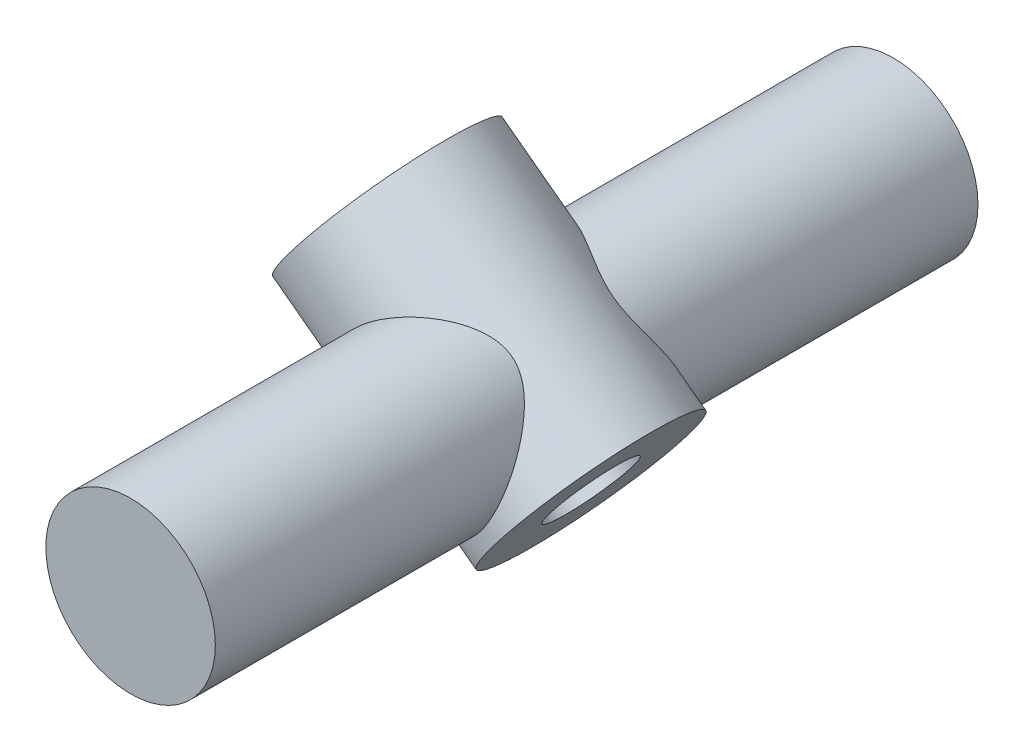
ISO-10303-21;
HEADER;
FILE_DESCRIPTION(('STEP AP214'),'2;1');
FILE_NAME('part.step','',(''),(''),'','','');
FILE_SCHEMA(('AUTOMOTIVE_DESIGN { 1 0 10303 214 1 1 1 1 }'));
ENDSEC;
DATA;
#1=APPLICATION_CONTEXT('core data for automotive mechanical design processes');
#2=APPLICATION_PROTOCOL_DEFINITION('international standard','automotive_design',2000,#1);
#3=PRODUCT_CONTEXT('',#1,'mechanical');
#4=PRODUCT('Part','Part','',(#3));
#5=PRODUCT_RELATED_PRODUCT_CATEGORY('part','',(#4));
#6=PRODUCT_DEFINITION_FORMATION('','',#4);
#7=PRODUCT_DEFINITION_CONTEXT('part definition',#1,'design');
#8=PRODUCT_DEFINITION('design','',#6,#7);
#9=PRODUCT_DEFINITION_SHAPE('','',#8);
#10=(LENGTH_UNIT() NAMED_UNIT(*) SI_UNIT(.MILLI.,.METRE.));
#11=(NAMED_UNIT(*) PLANE_ANGLE_UNIT() SI_UNIT($,.RADIAN.));
#12=(NAMED_UNIT(*) SI_UNIT($,.STERADIAN.) SOLID_ANGLE_UNIT());
#13=UNCERTAINTY_MEASURE_WITH_UNIT(LENGTH_MEASURE(1.E-05),#10,'distance_accuracy_value','');
#14=(GEOMETRIC_REPRESENTATION_CONTEXT(3) GLOBAL_UNCERTAINTY_ASSIGNED_CONTEXT((#13)) GLOBAL_UNIT_ASSIGNED_CONTEXT((#10,
#11,#12)) REPRESENTATION_CONTEXT('',''));
#15=CARTESIAN_POINT('',(0.,0.,0.));
#16=DIRECTION('',(0.,0.,1.));
#17=DIRECTION('',(1.,0.,0.));
#18=AXIS2_PLACEMENT_3D('',#15,#16,#17);
#19=CARTESIAN_POINT('',(-215.759160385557,344.756610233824,-27.));
#20=DIRECTION('',(0.,0.,1.));
#21=DIRECTION('',(1.,0.,0.));
#22=AXIS2_PLACEMENT_3D('',#19,#20,#21);
#23=CYLINDRICAL_SURFACE('',#22,6.00000000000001);
#24=CARTESIAN_POINT('',(-209.759160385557,344.756610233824,-6.00647164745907));
#25=CARTESIAN_POINT('',(-209.759159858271,344.948593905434,-5.91447663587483));
#26=CARTESIAN_POINT('',(-209.768371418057,345.138782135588,-5.8186259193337));
#27=CARTESIAN_POINT('',(-209.804243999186,345.514667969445,-5.62149603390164));
#28=CARTESIAN_POINT('',(-209.8309128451,345.700363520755,-5.5202144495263));
#29=CARTESIAN_POINT('',(-209.901121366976,346.067507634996,-5.31408722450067));
#30=CARTESIAN_POINT('',(-209.944728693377,346.248936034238,-5.20922885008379));
#31=CARTESIAN_POINT('',(-210.048421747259,346.606506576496,-4.99882773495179));
#32=CARTESIAN_POINT('',(-210.10850028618,346.782650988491,-4.89328531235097));
#33=CARTESIAN_POINT('',(-210.228797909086,347.087948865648,-4.7095229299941));
#34=CARTESIAN_POINT('',(-210.285507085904,347.21821392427,-4.63083744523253));
#35=CARTESIAN_POINT('',(-210.408786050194,347.475781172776,-4.47629668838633));
#36=CARTESIAN_POINT('',(-210.475357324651,347.603082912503,-4.40044184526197));
#37=CARTESIAN_POINT('',(-210.618632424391,347.854321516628,-4.25379998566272));
#38=CARTESIAN_POINT('',(-210.69530656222,347.978267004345,-4.18299902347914));
#39=CARTESIAN_POINT('',(-210.859500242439,348.222882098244,-4.04890148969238));
#40=CARTESIAN_POINT('',(-210.947012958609,348.34355370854,-3.98560024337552));
#41=CARTESIAN_POINT('',(-211.1544320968,348.607646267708,-3.85699658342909));
#42=CARTESIAN_POINT('',(-211.277221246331,348.750191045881,-3.79435214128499));
#43=CARTESIAN_POINT('',(-211.474471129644,348.957866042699,-3.71836269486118));
#44=CARTESIAN_POINT('',(-211.542348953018,349.026023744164,-3.69603803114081));
#45=CARTESIAN_POINT('',(-211.682308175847,349.159863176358,-3.65828682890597));
#46=CARTESIAN_POINT('',(-211.754387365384,349.225546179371,-3.64285670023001));
#47=CARTESIAN_POINT('',(-211.903181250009,349.354568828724,-3.61952771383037));
#48=CARTESIAN_POINT('',(-211.979937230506,349.417875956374,-3.61171104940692));
#49=CARTESIAN_POINT('',(-212.136758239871,349.54076366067,-3.60433802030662));
#50=CARTESIAN_POINT('',(-212.216823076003,349.600344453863,-3.60478117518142));
#51=CARTESIAN_POINT('',(-212.379552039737,349.715256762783,-3.61390407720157));
#52=CARTESIAN_POINT('',(-212.462217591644,349.770585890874,-3.62258841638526));
#53=CARTESIAN_POINT('',(-212.629373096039,349.876594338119,-3.64771818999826));
#54=CARTESIAN_POINT('',(-212.713864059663,349.927270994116,-3.66416803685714));
#55=CARTESIAN_POINT('',(-212.899785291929,350.032728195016,-3.70771772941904));
#56=CARTESIAN_POINT('',(-213.001444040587,350.086519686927,-3.73622911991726));
#57=CARTESIAN_POINT('',(-213.205584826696,350.187285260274,-3.80138227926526));
#58=CARTESIAN_POINT('',(-213.308067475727,350.234253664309,-3.83803075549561));
#59=CARTESIAN_POINT('',(-213.513607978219,350.321680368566,-3.91789737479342));
#60=CARTESIAN_POINT('',(-213.616666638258,350.362119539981,-3.9611341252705));
#61=CARTESIAN_POINT('',(-213.822802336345,350.436621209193,-4.05260149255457));
#62=CARTESIAN_POINT('',(-213.925879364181,350.470685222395,-4.10083091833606));
#63=CARTESIAN_POINT('',(-214.20151436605,350.553699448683,-4.23481105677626));
#64=CARTESIAN_POINT('',(-214.374077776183,350.597208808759,-4.32394192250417));
#65=CARTESIAN_POINT('',(-214.719297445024,350.668442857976,-4.50818389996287));
#66=CARTESIAN_POINT('',(-214.891953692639,350.696157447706,-4.60329879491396));
#67=CARTESIAN_POINT('',(-215.237740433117,350.73644706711,-4.79637103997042));
#68=CARTESIAN_POINT('',(-215.410871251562,350.749001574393,-4.89433205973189));
#69=CARTESIAN_POINT('',(-215.757407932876,350.759112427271,-5.09043486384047));
#70=CARTESIAN_POINT('',(-215.93081372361,350.756672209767,-5.18857660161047));
#71=CARTESIAN_POINT('',(-216.28639439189,350.736182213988,-5.3877824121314));
#72=CARTESIAN_POINT('',(-216.468579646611,350.717367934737,-5.48875163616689));
#73=CARTESIAN_POINT('',(-216.832758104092,350.662648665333,-5.68646141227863));
#74=CARTESIAN_POINT('',(-217.014751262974,350.62674037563,-5.78320114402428));
#75=CARTESIAN_POINT('',(-217.377239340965,350.537317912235,-5.97008018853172));
#76=CARTESIAN_POINT('',(-217.557736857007,350.483847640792,-6.06023528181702));
#77=CARTESIAN_POINT('',(-217.91639888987,350.358606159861,-6.23202850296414));
#78=CARTESIAN_POINT('',(-218.09456453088,350.286844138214,-6.31367087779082));
#79=CARTESIAN_POINT('',(-218.392686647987,350.149438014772,-6.4427705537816));
#80=CARTESIAN_POINT('',(-218.513705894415,350.088690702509,-6.49302312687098));
#81=CARTESIAN_POINT('',(-218.753076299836,349.95805677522,-6.58762374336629));
#82=CARTESIAN_POINT('',(-218.871428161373,349.888172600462,-6.63197335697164));
#83=CARTESIAN_POINT('',(-219.104630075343,349.739276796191,-6.71402137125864));
#84=CARTESIAN_POINT('',(-219.21948074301,349.660266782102,-6.75172094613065));
#85=CARTESIAN_POINT('',(-219.444715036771,349.493310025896,-6.81975321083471));
#86=CARTESIAN_POINT('',(-219.555100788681,349.405367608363,-6.85008944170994));
#87=CARTESIAN_POINT('',(-219.771229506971,349.220206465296,-6.90297634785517));
#88=CARTESIAN_POINT('',(-219.876933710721,349.122926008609,-6.92546990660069));
#89=CARTESIAN_POINT('',(-220.081807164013,348.920201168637,-6.96185517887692));
#90=CARTESIAN_POINT('',(-220.180976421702,348.814756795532,-6.97574690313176));
#91=CARTESIAN_POINT('',(-220.371745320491,348.596539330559,-6.9945895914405));
#92=CARTESIAN_POINT('',(-220.463347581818,348.483768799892,-6.99954366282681));
#93=CARTESIAN_POINT('',(-220.638129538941,348.251855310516,-7.00039593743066));
#94=CARTESIAN_POINT('',(-220.721309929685,348.132712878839,-6.99629488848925));
#95=CARTESIAN_POINT('',(-220.870311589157,347.901921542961,-6.98004159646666));
#96=CARTESIAN_POINT('',(-220.937038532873,347.790792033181,-6.96877620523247));
#97=CARTESIAN_POINT('',(-221.062831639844,347.565126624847,-6.93928819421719));
#98=CARTESIAN_POINT('',(-221.121895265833,347.450589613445,-6.9210632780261));
#99=CARTESIAN_POINT('',(-221.232092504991,347.219017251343,-6.87799775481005));
#100=CARTESIAN_POINT('',(-221.283228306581,347.101982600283,-6.85315897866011));
#101=CARTESIAN_POINT('',(-221.377515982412,346.866167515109,-6.79729752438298));
#102=CARTESIAN_POINT('',(-221.420664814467,346.74738643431,-6.76627249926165));
#103=CARTESIAN_POINT('',(-221.540695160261,346.381718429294,-6.6624142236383));
#104=CARTESIAN_POINT('',(-221.604579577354,346.133084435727,-6.58023702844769));
#105=CARTESIAN_POINT('',(-221.699604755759,345.636996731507,-6.39638638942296));
#106=CARTESIAN_POINT('',(-221.730734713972,345.389543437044,-6.29470652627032));
#107=CARTESIAN_POINT('',(-221.758368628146,344.962973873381,-6.10502209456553));
#108=CARTESIAN_POINT('',(-221.761758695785,344.782777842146,-6.02030951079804));
#109=CARTESIAN_POINT('',(-221.752695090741,344.425823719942,-5.84471441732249));
#110=CARTESIAN_POINT('',(-221.740240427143,344.249065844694,-5.75383152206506));
#111=CARTESIAN_POINT('',(-221.700176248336,343.89900639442,-5.5674166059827));
#112=CARTESIAN_POINT('',(-221.672513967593,343.725719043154,-5.47186945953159));
#113=CARTESIAN_POINT('',(-221.602558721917,343.383591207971,-5.27830680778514));
#114=CARTESIAN_POINT('',(-221.560268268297,343.214749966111,-5.18029172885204));
#115=CARTESIAN_POINT('',(-221.460319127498,342.878254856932,-4.98181490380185));
#116=CARTESIAN_POINT('',(-221.402367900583,342.71069349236,-4.88134365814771));
#117=CARTESIAN_POINT('',(-221.271365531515,342.380223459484,-4.68238434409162));
#118=CARTESIAN_POINT('',(-221.198307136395,342.217317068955,-4.58389725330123));
#119=CARTESIAN_POINT('',(-221.036783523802,341.896751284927,-4.39251587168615));
#120=CARTESIAN_POINT('',(-220.948372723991,341.739075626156,-4.29960333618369));
#121=CARTESIAN_POINT('',(-220.755012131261,341.428715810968,-4.12349614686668));
#122=CARTESIAN_POINT('',(-220.650082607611,341.276025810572,-4.0402897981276));
#123=CARTESIAN_POINT('',(-220.424411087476,340.979124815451,-3.89114953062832));
#124=CARTESIAN_POINT('',(-220.304034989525,340.834804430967,-3.8248981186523));
#125=CARTESIAN_POINT('',(-220.110216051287,340.624128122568,-3.74268024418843));
#126=CARTESIAN_POINT('',(-220.043459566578,340.554923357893,-3.71814700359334));
#127=CARTESIAN_POINT('',(-219.905622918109,340.418844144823,-3.67574691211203));
#128=CARTESIAN_POINT('',(-219.834545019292,340.351968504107,-3.65787660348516));
#129=CARTESIAN_POINT('',(-219.687472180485,340.220287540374,-3.62947481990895));
#130=CARTESIAN_POINT('',(-219.611428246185,340.155516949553,-3.61903452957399));
#131=CARTESIAN_POINT('',(-219.455773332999,340.029552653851,-3.60642726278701));
#132=CARTESIAN_POINT('',(-219.376162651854,339.968358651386,-3.60425959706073));
#133=CARTESIAN_POINT('',(-219.214088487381,339.850131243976,-3.60832485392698));
#134=CARTESIAN_POINT('',(-219.131624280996,339.793098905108,-3.61455992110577));
#135=CARTESIAN_POINT('',(-218.964620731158,339.683642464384,-3.63507666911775));
#136=CARTESIAN_POINT('',(-218.88008028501,339.631220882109,-3.64936271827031));
#137=CARTESIAN_POINT('',(-218.69771500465,339.524250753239,-3.687754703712));
#138=CARTESIAN_POINT('',(-218.599691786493,339.470437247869,-3.71295789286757));
#139=CARTESIAN_POINT('',(-218.402694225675,339.369216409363,-3.77142101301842));
#140=CARTESIAN_POINT('',(-218.303719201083,339.321814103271,-3.80468720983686));
#141=CARTESIAN_POINT('',(-218.105110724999,339.233171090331,-3.87784148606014));
#142=CARTESIAN_POINT('',(-218.005476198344,339.191948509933,-3.91774834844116));
#143=CARTESIAN_POINT('',(-217.806134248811,339.115574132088,-4.00269544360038));
#144=CARTESIAN_POINT('',(-217.706426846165,339.080421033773,-4.04773457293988));
#145=CARTESIAN_POINT('',(-217.439855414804,338.994141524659,-4.17338722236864));
#146=CARTESIAN_POINT('',(-217.272972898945,338.948195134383,-4.25753622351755));
#147=CARTESIAN_POINT('',(-216.939166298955,338.871294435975,-4.43239029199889));
#148=CARTESIAN_POINT('',(-216.772242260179,338.840350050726,-4.52309965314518));
#149=CARTESIAN_POINT('',(-216.437985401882,338.792742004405,-4.70798715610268));
#150=CARTESIAN_POINT('',(-216.270652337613,338.776098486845,-4.80216999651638));
#151=CARTESIAN_POINT('',(-215.935739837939,338.75686498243,-4.9914127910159));
#152=CARTESIAN_POINT('',(-215.768160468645,338.754271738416,-5.08647253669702));
#153=CARTESIAN_POINT('',(-215.422721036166,338.763412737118,-5.28115655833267));
#154=CARTESIAN_POINT('',(-215.244845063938,338.776012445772,-5.38071413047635));
#155=CARTESIAN_POINT('',(-214.889087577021,338.817330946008,-5.57653831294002));
#156=CARTESIAN_POINT('',(-214.711206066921,338.846052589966,-5.67280433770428));
#157=CARTESIAN_POINT('',(-214.356506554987,338.920061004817,-5.85983205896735));
#158=CARTESIAN_POINT('',(-214.179687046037,338.965309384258,-5.95060594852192));
#159=CARTESIAN_POINT('',(-213.827664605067,339.073021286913,-6.12491879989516));
#160=CARTESIAN_POINT('',(-213.652461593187,339.135483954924,-6.20845812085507));
#161=CARTESIAN_POINT('',(-213.352537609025,339.258719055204,-6.34469923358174));
#162=CARTESIAN_POINT('',(-213.227083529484,339.315304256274,-6.39959658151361));
#163=CARTESIAN_POINT('',(-212.978510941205,339.438039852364,-6.50365773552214));
#164=CARTESIAN_POINT('',(-212.855391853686,339.504187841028,-6.55282297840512));
#165=CARTESIAN_POINT('',(-212.612308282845,339.646118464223,-6.64460845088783));
#166=CARTESIAN_POINT('',(-212.492343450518,339.721900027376,-6.68722940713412));
#167=CARTESIAN_POINT('',(-212.256552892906,339.88299601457,-6.7651224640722));
#168=CARTESIAN_POINT('',(-212.140725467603,339.968306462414,-6.800397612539));
#169=CARTESIAN_POINT('',(-211.913285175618,340.148953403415,-6.86314226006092));
#170=CARTESIAN_POINT('',(-211.801714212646,340.244365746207,-6.89054599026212));
#171=CARTESIAN_POINT('',(-211.584921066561,340.444134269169,-6.93652674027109));
#172=CARTESIAN_POINT('',(-211.479698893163,340.548490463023,-6.95510374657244));
#173=CARTESIAN_POINT('',(-211.276782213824,340.765329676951,-6.98296050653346));
#174=CARTESIAN_POINT('',(-211.179083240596,340.877807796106,-6.99224581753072));
#175=CARTESIAN_POINT('',(-210.992174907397,341.109961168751,-7.00129540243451));
#176=CARTESIAN_POINT('',(-210.902964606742,341.229635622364,-7.00106073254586));
#177=CARTESIAN_POINT('',(-210.744070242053,341.460240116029,-6.99168411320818));
#178=CARTESIAN_POINT('',(-210.673328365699,341.570488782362,-6.98361772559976));
#179=CARTESIAN_POINT('',(-210.539484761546,341.794844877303,-6.9602900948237));
#180=CARTESIAN_POINT('',(-210.476385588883,341.908953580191,-6.94502645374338));
#181=CARTESIAN_POINT('',(-210.358157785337,342.140120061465,-6.90759601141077));
#182=CARTESIAN_POINT('',(-210.303028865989,342.257177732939,-6.88542946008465));
#183=CARTESIAN_POINT('',(-210.200873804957,342.493418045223,-6.83460086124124));
#184=CARTESIAN_POINT('',(-210.15385069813,342.612601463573,-6.80593639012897));
#185=CARTESIAN_POINT('',(-210.023963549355,342.975087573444,-6.71011624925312));
#186=CARTESIAN_POINT('',(-209.953687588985,343.220551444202,-6.63359641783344));
#187=CARTESIAN_POINT('',(-209.845611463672,343.711093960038,-6.46050969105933));
#188=CARTESIAN_POINT('',(-209.80778756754,343.956172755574,-6.36395750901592));
#189=CARTESIAN_POINT('',(-209.776377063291,344.292768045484,-6.2196664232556));
#190=CARTESIAN_POINT('',(-209.769889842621,344.386070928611,-6.17840664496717));
#191=CARTESIAN_POINT('',(-209.761282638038,344.571923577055,-6.09388385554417));
#192=CARTESIAN_POINT('',(-209.759160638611,344.664473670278,-6.05062177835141));
#193=CARTESIAN_POINT('',(-209.759160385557,344.756610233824,-6.00647164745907));
#194=B_SPLINE_CURVE_WITH_KNOTS('',3,(#24,#25,#26,#27,#28,#29,#30,#31,#32,#33,#34,#35,#36,#37,
#38,#39,#40,#41,#42,#43,#44,#45,#46,#47,#48,#49,#50,#51,#52,#53,#54,#55,#56,#57,#58,#59,#60,#61,
#62,#63,#64,#65,#66,#67,#68,#69,#70,#71,#72,#73,#74,#75,#76,#77,#78,#79,#80,#81,#82,#83,#84,#85,
#86,#87,#88,#89,#90,#91,#92,#93,#94,#95,#96,#97,#98,#99,#100,#101,#102,#103,#104,#105,#106,#107,
#108,#109,#110,#111,#112,#113,#114,#115,#116,#117,#118,#119,#120,#121,#122,#123,#124,#125,#126,
#127,#128,#129,#130,#131,#132,#133,#134,#135,#136,#137,#138,#139,#140,#141,#142,#143,#144,#145,
#146,#147,#148,#149,#150,#151,#152,#153,#154,#155,#156,#157,#158,#159,#160,#161,#162,#163,#164,
#165,#166,#167,#168,#169,#170,#171,#172,#173,#174,#175,#176,#177,#178,#179,#180,#181,#182,#183,
#184,#185,#186,#187,#188,#189,#190,#191,#192,#193),.UNSPECIFIED.,.T.,.F.,(4,2,2,2,2,2,2,2,2,2,2,
2,2,2,2,2,2,2,2,2,2,2,2,2,2,2,2,2,2,2,2,2,2,2,2,2,2,2,2,2,2,2,2,2,2,2,2,2,2,2,2,2,2,2,2,2,2,2,2,
2,2,2,2,2,2,2,2,2,2,2,2,2,2,2,2,2,2,2,2,2,2,2,2,2,4),(0.,0.638543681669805,1.27737376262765,
1.91878193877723,2.55991062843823,3.04682251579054,3.53380789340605,4.01939290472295,
4.50467363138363,5.09736067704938,5.3933079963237,5.68910102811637,5.98805310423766,
6.28698779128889,6.58608914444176,6.88536065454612,7.24027975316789,7.59549250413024,
7.95172775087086,8.30787821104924,8.90407050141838,9.50064357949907,10.0980233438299,
10.6952661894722,11.321987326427,11.948829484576,12.5741164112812,13.199089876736,
13.6320073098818,14.0648093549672,14.4975349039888,14.930051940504,15.3656561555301,
15.8012598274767,16.2367120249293,16.6721282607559,17.0620084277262,17.4520173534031,
17.8419184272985,18.2319677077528,19.0372982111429,19.8428942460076,20.4395705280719,
21.0362841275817,21.6350813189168,22.2337757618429,22.8445356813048,23.4555895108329,
24.0645200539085,24.6727091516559,25.2685015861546,25.5659201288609,25.8631841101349,
26.1640361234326,26.4648630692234,26.765766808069,27.0668339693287,27.4101787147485,
27.7537911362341,28.0983925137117,28.4429199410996,29.0194044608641,29.5962697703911,
30.1739462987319,30.7514889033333,31.3635452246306,31.9757098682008,32.5864614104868,
33.1971826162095,33.6413016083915,34.085309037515,34.5292671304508,34.9730406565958,
35.4204208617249,35.8678017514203,36.3149149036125,36.7619784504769,37.1552293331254,
37.5486113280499,37.9419790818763,38.3354937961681,39.1318497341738,39.9276228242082,
40.2342135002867,40.5406625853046),.UNSPECIFIED.);
#195=CARTESIAN_POINT('',(-209.759160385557,344.756610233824,-6.00647164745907));
#196=VERTEX_POINT('',#195);
#197=EDGE_CURVE('E11',#196,#196,#194,.T.);
#198=ORIENTED_EDGE('',*,*,#197,.F.);
#199=EDGE_LOOP('',(#198));
#200=FACE_BOUND('',#199,.T.);
#201=CARTESIAN_POINT('',(-215.759160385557,344.756610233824,-27.));
#202=DIRECTION('',(0.,0.,1.));
#203=DIRECTION('',(1.,0.,0.));
#204=AXIS2_PLACEMENT_3D('',#201,#202,#203);
#205=CIRCLE('',#204,6.00000000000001);
#206=CARTESIAN_POINT('',(-209.759160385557,344.756610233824,-27.));
#207=VERTEX_POINT('',#206);
#208=EDGE_CURVE('E115',#207,#207,#205,.T.);
#209=ORIENTED_EDGE('',*,*,#208,.T.);
#210=EDGE_LOOP('',(#209));
#211=FACE_BOUND('',#210,.T.);
#212=ADVANCED_FACE('F52',(#200,#211),#23,.T.);
#213=CARTESIAN_POINT('',(-215.759160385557,344.756610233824,-27.));
#214=DIRECTION('',(0.,0.,1.));
#215=DIRECTION('',(1.,0.,0.));
#216=AXIS2_PLACEMENT_3D('',#213,#214,#215);
#217=PLANE('',#216);
#218=ORIENTED_EDGE('',*,*,#208,.F.);
#219=EDGE_LOOP('',(#218));
#220=FACE_BOUND('',#219,.T.);
#221=ADVANCED_FACE('F54',(#220),#217,.F.);
#222=CARTESIAN_POINT('',(-210.154580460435,340.562723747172,0.));
#223=DIRECTION('',(-0.800654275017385,0.599126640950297,0.));
#224=DIRECTION('',(-0.599126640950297,-0.800654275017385,0.));
#225=AXIS2_PLACEMENT_3D('',#222,#223,#224);
#226=PLANE('',#225);
#227=CARTESIAN_POINT('',(-210.154580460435,340.562723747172,0.));
#228=DIRECTION('',(-0.800654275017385,0.599126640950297,0.));
#229=DIRECTION('',(-0.599126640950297,-0.800654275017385,0.));
#230=AXIS2_PLACEMENT_3D('',#227,#228,#229);
#231=CIRCLE('',#230,3.);
#232=CARTESIAN_POINT('',(-211.951960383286,338.16076092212,0.));
#233=VERTEX_POINT('',#232);
#234=EDGE_CURVE('E125',#233,#233,#231,.T.);
#235=ORIENTED_EDGE('',*,*,#234,.T.);
#236=EDGE_LOOP('',(#235));
#237=FACE_BOUND('',#236,.T.);
#238=CARTESIAN_POINT('',(-210.154580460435,340.562723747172,0.));
#239=DIRECTION('',(-0.800654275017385,0.599126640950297,0.));
#240=DIRECTION('',(-0.599126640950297,-0.800654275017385,0.));
#241=AXIS2_PLACEMENT_3D('',#238,#239,#240);
#242=CIRCLE('',#241,7.);
#243=CARTESIAN_POINT('',(-214.348466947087,334.95814382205,0.));
#244=VERTEX_POINT('',#243);
#245=EDGE_CURVE('E122',#244,#244,#242,.T.);
#246=ORIENTED_EDGE('',*,*,#245,.F.);
#247=EDGE_LOOP('',(#246));
#248=FACE_BOUND('',#247,.T.);
#249=ADVANCED_FACE('F88',(#237,#248),#226,.F.);
#250=CARTESIAN_POINT('',(-224.566357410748,351.347003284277,0.));
#251=DIRECTION('',(-0.800654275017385,0.599126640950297,0.));
#252=DIRECTION('',(-0.599126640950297,-0.800654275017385,0.));
#253=AXIS2_PLACEMENT_3D('',#250,#251,#252);
#254=PLANE('',#253);
#255=CARTESIAN_POINT('',(-224.566357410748,351.347003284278,0.));
#256=DIRECTION('',(-0.800654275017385,0.599126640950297,0.));
#257=DIRECTION('',(-0.599126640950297,-0.800654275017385,0.));
#258=AXIS2_PLACEMENT_3D('',#255,#256,#257);
#259=CIRCLE('',#258,3.);
#260=CARTESIAN_POINT('',(-226.363737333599,348.945040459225,0.));
#261=VERTEX_POINT('',#260);
#262=EDGE_CURVE('E56',#261,#261,#259,.T.);
#263=ORIENTED_EDGE('',*,*,#262,.F.);
#264=EDGE_LOOP('',(#263));
#265=FACE_BOUND('',#264,.T.);
#266=CARTESIAN_POINT('',(-224.566357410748,351.347003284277,0.));
#267=DIRECTION('',(-0.800654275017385,0.599126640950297,0.));
#268=DIRECTION('',(-0.599126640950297,-0.800654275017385,0.));
#269=AXIS2_PLACEMENT_3D('',#266,#267,#268);
#270=CIRCLE('',#269,7.);
#271=CARTESIAN_POINT('',(-228.7602438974,345.742423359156,0.));
#272=VERTEX_POINT('',#271);
#273=EDGE_CURVE('E117',#272,#272,#270,.T.);
#274=ORIENTED_EDGE('',*,*,#273,.T.);
#275=EDGE_LOOP('',(#274));
#276=FACE_BOUND('',#275,.T.);
#277=ADVANCED_FACE('F84',(#265,#276),#254,.T.);
#278=CARTESIAN_POINT('',(-210.154580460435,340.562723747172,0.));
#279=DIRECTION('',(-0.800654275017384,0.599126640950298,0.));
#280=DIRECTION('',(-0.599126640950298,-0.800654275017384,0.));
#281=AXIS2_PLACEMENT_3D('',#278,#279,#280);
#282=CYLINDRICAL_SURFACE('',#281,7.);
#283=ORIENTED_EDGE('',*,*,#197,.T.);
#284=EDGE_LOOP('',(#283));
#285=FACE_BOUND('',#284,.T.);
#286=CARTESIAN_POINT('',(-209.759160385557,344.756610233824,6.00647164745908));
#287=CARTESIAN_POINT('',(-209.759172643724,344.479170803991,6.13940388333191));
#288=CARTESIAN_POINT('',(-209.77842491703,344.197621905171,6.26443874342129));
#289=CARTESIAN_POINT('',(-209.83862793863,343.772831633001,6.43461724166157));
#290=CARTESIAN_POINT('',(-209.863947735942,343.630714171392,6.48848228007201));
#291=CARTESIAN_POINT('',(-209.92541445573,343.34646002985,6.58950059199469));
#292=CARTESIAN_POINT('',(-209.961556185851,343.204323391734,6.63665706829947));
#293=CARTESIAN_POINT('',(-210.04533939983,342.91963577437,6.72377141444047));
#294=CARTESIAN_POINT('',(-210.09308625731,342.777093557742,6.76365709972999));
#295=CARTESIAN_POINT('',(-210.199990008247,342.494206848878,6.83478209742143));
#296=CARTESIAN_POINT('',(-210.259141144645,342.353861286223,6.86602575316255));
#297=CARTESIAN_POINT('',(-210.38870650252,342.076760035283,6.91910639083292));
#298=CARTESIAN_POINT('',(-210.459111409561,341.940001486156,6.94095109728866));
#299=CARTESIAN_POINT('',(-210.610833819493,341.671401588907,6.97468936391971));
#300=CARTESIAN_POINT('',(-210.692149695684,341.539559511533,6.98658440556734));
#301=CARTESIAN_POINT('',(-210.85446427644,341.297927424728,6.99927485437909));
#302=CARTESIAN_POINT('',(-210.934291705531,341.187409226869,7.00124723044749));
#303=CARTESIAN_POINT('',(-211.101212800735,340.972159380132,6.99723233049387));
#304=CARTESIAN_POINT('',(-211.188306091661,340.867427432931,6.99124546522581));
#305=CARTESIAN_POINT('',(-211.369006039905,340.664544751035,6.97144256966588));
#306=CARTESIAN_POINT('',(-211.46261245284,340.56639376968,6.95762683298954));
#307=CARTESIAN_POINT('',(-211.655512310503,340.37730471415,6.92245945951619));
#308=CARTESIAN_POINT('',(-211.754805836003,340.286366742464,6.90110771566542));
#309=CARTESIAN_POINT('',(-211.953327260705,340.116364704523,6.85249180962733));
#310=CARTESIAN_POINT('',(-212.05232864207,340.036939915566,6.82556139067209));
#311=CARTESIAN_POINT('',(-212.253989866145,339.885293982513,6.76571338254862));
#312=CARTESIAN_POINT('',(-212.356651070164,339.813075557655,6.73279354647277));
#313=CARTESIAN_POINT('',(-212.669085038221,339.607486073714,6.62578614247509));
#314=CARTESIAN_POINT('',(-212.883410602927,339.485093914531,6.54342495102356));
#315=CARTESIAN_POINT('',(-213.253527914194,339.302179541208,6.38855738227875));
#316=CARTESIAN_POINT('',(-213.407598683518,339.234110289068,6.32050244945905));
#317=CARTESIAN_POINT('',(-213.718050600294,339.111996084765,6.17724145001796));
#318=CARTESIAN_POINT('',(-213.874432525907,339.057955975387,6.10203292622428));
#319=CARTESIAN_POINT('',(-214.188695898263,338.963456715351,5.94581885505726));
#320=CARTESIAN_POINT('',(-214.346579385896,338.923020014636,5.86480399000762));
#321=CARTESIAN_POINT('',(-214.662889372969,338.855394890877,5.69849952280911));
#322=CARTESIAN_POINT('',(-214.82131581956,338.82820521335,5.61321032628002));
#323=CARTESIAN_POINT('',(-215.141089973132,338.786312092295,5.43819631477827));
#324=CARTESIAN_POINT('',(-215.302439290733,338.771840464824,5.34841947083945));
#325=CARTESIAN_POINT('',(-215.6249717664,338.755937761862,5.16739581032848));
#326=CARTESIAN_POINT('',(-215.786154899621,338.754508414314,5.07614880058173));
#327=CARTESIAN_POINT('',(-216.108165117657,338.764604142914,4.89392925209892));
#328=CARTESIAN_POINT('',(-216.268992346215,338.776122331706,4.80295659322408));
#329=CARTESIAN_POINT('',(-216.590381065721,338.812267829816,4.62329268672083));
#330=CARTESIAN_POINT('',(-216.750942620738,338.836891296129,4.5346007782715));
#331=CARTESIAN_POINT('',(-217.131640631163,338.911381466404,4.32991018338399));
#332=CARTESIAN_POINT('',(-217.351781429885,338.967223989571,4.21598709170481));
#333=CARTESIAN_POINT('',(-217.79201170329,339.106767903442,4.00646960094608));
#334=CARTESIAN_POINT('',(-218.012100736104,339.190426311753,3.9108472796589));
#335=CARTESIAN_POINT('',(-218.397371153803,339.364684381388,3.77127775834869));
#336=CARTESIAN_POINT('',(-218.562910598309,339.448667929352,3.72042106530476));
#337=CARTESIAN_POINT('',(-218.807868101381,339.588029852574,3.66354270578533));
#338=CARTESIAN_POINT('',(-218.88890952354,339.636678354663,3.64782169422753));
#339=CARTESIAN_POINT('',(-219.049334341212,339.738268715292,3.62351253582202));
#340=CARTESIAN_POINT('',(-219.128718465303,339.791208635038,3.6149211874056));
#341=CARTESIAN_POINT('',(-219.285657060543,339.901399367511,3.60528370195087));
#342=CARTESIAN_POINT('',(-219.36319709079,339.958674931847,3.6042847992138));
#343=CARTESIAN_POINT('',(-219.515244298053,340.076749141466,3.61000763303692));
#344=CARTESIAN_POINT('',(-219.589751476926,340.137547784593,3.61672936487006));
#345=CARTESIAN_POINT('',(-219.735259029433,340.262188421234,3.63755342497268));
#346=CARTESIAN_POINT('',(-219.806254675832,340.326034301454,3.65166542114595));
#347=CARTESIAN_POINT('',(-219.94427362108,340.45616335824,3.68659360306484));
#348=CARTESIAN_POINT('',(-220.011294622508,340.522447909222,3.7074136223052));
#349=CARTESIAN_POINT('',(-220.249436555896,340.769187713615,3.79451295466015));
#350=CARTESIAN_POINT('',(-220.407882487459,340.955798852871,3.87872327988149));
#351=CARTESIAN_POINT('',(-220.623625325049,341.242149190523,4.02369127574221));
#352=CARTESIAN_POINT('',(-220.692011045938,341.338890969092,4.07525648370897));
#353=CARTESIAN_POINT('',(-220.821891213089,341.534423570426,4.18304250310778));
#354=CARTESIAN_POINT('',(-220.88338677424,341.633214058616,4.23926255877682));
#355=CARTESIAN_POINT('',(-221.036873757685,341.896269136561,4.39184253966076));
#356=CARTESIAN_POINT('',(-221.123338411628,342.062155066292,4.49095944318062));
#357=CARTESIAN_POINT('',(-221.279714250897,342.399074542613,4.69352551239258));
#358=CARTESIAN_POINT('',(-221.349615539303,342.570111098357,4.79697722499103));
#359=CARTESIAN_POINT('',(-221.47325791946,342.917306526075,5.00492495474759));
#360=CARTESIAN_POINT('',(-221.526999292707,343.093465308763,5.1094209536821));
#361=CARTESIAN_POINT('',(-221.618240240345,343.450788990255,5.31680816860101));
#362=CARTESIAN_POINT('',(-221.655745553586,343.631952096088,5.41969993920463));
#363=CARTESIAN_POINT('',(-221.709915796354,343.973069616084,5.60731232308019));
#364=CARTESIAN_POINT('',(-221.728780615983,344.132392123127,5.69254197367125));
#365=CARTESIAN_POINT('',(-221.753711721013,344.45422230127,5.85876833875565));
#366=CARTESIAN_POINT('',(-221.759774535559,344.616730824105,5.93976389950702));
#367=CARTESIAN_POINT('',(-221.757790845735,345.107687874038,6.17398914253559));
#368=CARTESIAN_POINT('',(-221.729721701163,345.440470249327,6.31896688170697));
#369=CARTESIAN_POINT('',(-221.626686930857,346.038675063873,6.54769971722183));
#370=CARTESIAN_POINT('',(-221.562853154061,346.303510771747,6.63791822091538));
#371=CARTESIAN_POINT('',(-221.438256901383,346.697458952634,6.75287430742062));
#372=CARTESIAN_POINT('',(-221.391900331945,346.828259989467,6.78780459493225));
#373=CARTESIAN_POINT('',(-221.289524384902,347.087812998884,6.85022112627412));
#374=CARTESIAN_POINT('',(-221.233509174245,347.216565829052,6.87771056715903));
#375=CARTESIAN_POINT('',(-221.111521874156,347.47182086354,6.92482941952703));
#376=CARTESIAN_POINT('',(-221.04548723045,347.59830291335,6.94440640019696));
#377=CARTESIAN_POINT('',(-220.904051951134,347.847006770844,6.97499715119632));
#378=CARTESIAN_POINT('',(-220.828651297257,347.969228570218,6.98601090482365));
#379=CARTESIAN_POINT('',(-220.669044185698,348.208230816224,6.99920800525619));
#380=CARTESIAN_POINT('',(-220.584840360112,348.325012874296,7.0013939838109));
#381=CARTESIAN_POINT('',(-220.408343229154,348.552104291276,6.99688843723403));
#382=CARTESIAN_POINT('',(-220.316050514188,348.662414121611,6.99019755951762));
#383=CARTESIAN_POINT('',(-220.133842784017,348.864994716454,6.96920845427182));
#384=CARTESIAN_POINT('',(-220.044609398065,348.957967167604,6.95573590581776));
#385=CARTESIAN_POINT('',(-219.860991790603,349.137416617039,6.92198605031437));
#386=CARTESIAN_POINT('',(-219.766605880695,349.223891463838,6.90170650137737));
#387=CARTESIAN_POINT('',(-219.573470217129,349.389886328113,6.85471286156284));
#388=CARTESIAN_POINT('',(-219.474721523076,349.469408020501,6.82800032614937));
#389=CARTESIAN_POINT('',(-219.273552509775,349.621274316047,6.76858917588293));
#390=CARTESIAN_POINT('',(-219.171130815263,349.693616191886,6.73588829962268));
#391=CARTESIAN_POINT('',(-218.849662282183,349.906044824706,6.62621602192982));
#392=CARTESIAN_POINT('',(-218.625476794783,350.033774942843,6.53991657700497));
#393=CARTESIAN_POINT('',(-218.169617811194,350.256998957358,6.34825357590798));
#394=CARTESIAN_POINT('',(-217.937942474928,350.352484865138,6.24288530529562));
#395=CARTESIAN_POINT('',(-217.530515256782,350.492124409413,6.04672482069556));
#396=CARTESIAN_POINT('',(-217.3555532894,350.543158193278,5.95905828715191));
#397=CARTESIAN_POINT('',(-217.004650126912,350.62869439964,5.77782014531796));
#398=CARTESIAN_POINT('',(-216.828708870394,350.663195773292,5.68424816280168));
#399=CARTESIAN_POINT('',(-216.475883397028,350.716331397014,5.49273161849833));
#400=CARTESIAN_POINT('',(-216.298998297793,350.734899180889,5.39477051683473));
#401=CARTESIAN_POINT('',(-215.945457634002,350.756331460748,5.19684631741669));
#402=CARTESIAN_POINT('',(-215.768802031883,350.759198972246,5.09688360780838));
#403=CARTESIAN_POINT('',(-215.41219161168,350.749279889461,4.89507822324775));
#404=CARTESIAN_POINT('',(-215.232243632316,350.736170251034,4.79323914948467));
#405=CARTESIAN_POINT('',(-214.872486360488,350.693499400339,4.59249655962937));
#406=CARTESIAN_POINT('',(-214.692677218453,350.663928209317,4.49359486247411));
#407=CARTESIAN_POINT('',(-214.33391515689,350.587745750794,4.30296703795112));
#408=CARTESIAN_POINT('',(-214.154962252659,350.541216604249,4.21120887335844));
#409=CARTESIAN_POINT('',(-213.797238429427,350.429873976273,4.03960790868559));
#410=CARTESIAN_POINT('',(-213.618467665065,350.365089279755,3.959746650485));
#411=CARTESIAN_POINT('',(-213.271949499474,350.219836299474,3.82312376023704));
#412=CARTESIAN_POINT('',(-213.104172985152,350.140516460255,3.76527865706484));
#413=CARTESIAN_POINT('',(-212.855083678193,350.007818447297,3.69673893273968));
#414=CARTESIAN_POINT('',(-212.772554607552,349.961346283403,3.67693977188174));
#415=CARTESIAN_POINT('',(-212.608821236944,349.863901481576,3.64421532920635));
#416=CARTESIAN_POINT('',(-212.527616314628,349.812931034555,3.63128672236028));
#417=CARTESIAN_POINT('',(-212.366427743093,349.70623560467,3.61285448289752));
#418=CARTESIAN_POINT('',(-212.28646203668,349.650471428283,3.60741978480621));
#419=CARTESIAN_POINT('',(-212.129257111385,349.535031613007,3.60449438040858));
#420=CARTESIAN_POINT('',(-212.052017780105,349.475356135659,3.60700334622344));
#421=CARTESIAN_POINT('',(-211.900863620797,349.352590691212,3.61983193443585));
#422=CARTESIAN_POINT('',(-211.826952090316,349.289497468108,3.63015913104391));
#423=CARTESIAN_POINT('',(-211.683007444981,349.160509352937,3.65809502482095));
#424=CARTESIAN_POINT('',(-211.612976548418,349.094612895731,3.67570783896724));
#425=CARTESIAN_POINT('',(-211.460820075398,348.944482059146,3.72240928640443));
#426=CARTESIAN_POINT('',(-211.379826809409,348.859642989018,3.7532377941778));
#427=CARTESIAN_POINT('',(-211.224453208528,348.687248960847,3.82306803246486));
#428=CARTESIAN_POINT('',(-211.150078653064,348.599691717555,3.86207680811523));
#429=CARTESIAN_POINT('',(-211.007641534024,348.422134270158,3.94663700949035));
#430=CARTESIAN_POINT('',(-210.939600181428,348.332127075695,3.99220920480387));
#431=CARTESIAN_POINT('',(-210.809857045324,348.150261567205,4.08824945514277));
#432=CARTESIAN_POINT('',(-210.748153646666,348.058403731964,4.13871625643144));
#433=CARTESIAN_POINT('',(-210.591372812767,347.81072652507,4.27833787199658));
#434=CARTESIAN_POINT('',(-210.501665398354,347.653326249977,4.37074033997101));
#435=CARTESIAN_POINT('',(-210.337864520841,347.333780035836,4.5611038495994));
#436=CARTESIAN_POINT('',(-210.263781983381,347.171630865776,4.65906872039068));
#437=CARTESIAN_POINT('',(-210.130727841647,346.842792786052,4.85714574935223));
#438=CARTESIAN_POINT('',(-210.071739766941,346.676109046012,4.95725543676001));
#439=CARTESIAN_POINT('',(-209.96865338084,346.338136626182,5.15712240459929));
#440=CARTESIAN_POINT('',(-209.924547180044,346.166850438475,5.25687984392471));
#441=CARTESIAN_POINT('',(-209.845770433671,345.79283042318,5.46920771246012));
#442=CARTESIAN_POINT('',(-209.813610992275,345.589327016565,5.58137614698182));
#443=CARTESIAN_POINT('',(-209.770304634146,345.176879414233,5.79937960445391));
#444=CARTESIAN_POINT('',(-209.759151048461,344.967936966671,5.90521662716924));
#445=CARTESIAN_POINT('',(-209.759160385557,344.756610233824,6.00647164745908));
#446=B_SPLINE_CURVE_WITH_KNOTS('',3,(#286,#287,#288,#289,#290,#291,#292,#293,#294,#295,#296,
#297,#298,#299,#300,#301,#302,#303,#304,#305,#306,#307,#308,#309,#310,#311,#312,#313,#314,#315,
#316,#317,#318,#319,#320,#321,#322,#323,#324,#325,#326,#327,#328,#329,#330,#331,#332,#333,#334,
#335,#336,#337,#338,#339,#340,#341,#342,#343,#344,#345,#346,#347,#348,#349,#350,#351,#352,#353,
#354,#355,#356,#357,#358,#359,#360,#361,#362,#363,#364,#365,#366,#367,#368,#369,#370,#371,#372,
#373,#374,#375,#376,#377,#378,#379,#380,#381,#382,#383,#384,#385,#386,#387,#388,#389,#390,#391,
#392,#393,#394,#395,#396,#397,#398,#399,#400,#401,#402,#403,#404,#405,#406,#407,#408,#409,#410,
#411,#412,#413,#414,#415,#416,#417,#418,#419,#420,#421,#422,#423,#424,#425,#426,#427,#428,#429,
#430,#431,#432,#433,#434,#435,#436,#437,#438,#439,#440,#441,#442,#443,#444,#445),.UNSPECIFIED.,
.T.,.F.,(4,2,2,2,2,2,2,2,2,2,2,2,2,2,2,2,2,2,2,2,2,2,2,2,2,2,2,2,2,2,2,2,2,2,2,2,2,2,2,2,2,2,2,
2,2,2,2,2,2,2,2,2,2,2,2,2,2,2,2,2,2,2,2,2,2,2,2,2,2,2,2,2,2,2,2,2,2,2,2,4),(0.,
0.922205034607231,1.38401391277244,1.84560156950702,2.31154817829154,2.77726018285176,
3.24258870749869,3.70784793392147,4.11635352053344,4.52483802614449,4.9333072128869,
5.34178220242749,5.73061178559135,6.1195875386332,6.89713285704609,7.4415053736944,
7.98606555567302,8.53152007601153,9.07692293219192,9.63207231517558,10.1872952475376,
10.7422229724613,11.2969880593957,12.0575532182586,12.8169485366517,13.3919792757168,
13.6791152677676,13.966122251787,14.254913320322,14.5437042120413,14.8328738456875,
15.1222090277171,15.893782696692,16.2812737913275,16.6687020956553,17.3029193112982,
17.9375145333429,18.5720987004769,19.2064583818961,19.7509371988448,20.2955636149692,
21.3817089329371,22.2389175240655,22.667760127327,23.0964181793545,23.5278718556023,
23.959326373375,24.3906522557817,24.821946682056,25.210206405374,25.5985941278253,
25.9868880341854,26.3753288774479,27.18824377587,28.0013599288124,28.6073183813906,
29.2133152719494,29.821827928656,30.4302237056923,31.0511274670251,31.6724080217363,
32.29071908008,32.9080606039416,33.4890425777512,33.7790239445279,34.0688648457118,
34.3613545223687,34.6538321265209,34.9465934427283,35.2395204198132,35.6027669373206,
35.9663275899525,36.3310650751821,36.6957093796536,37.3049015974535,37.9145183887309,
38.5234671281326,39.1320925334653,39.8347629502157,40.5372102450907),.UNSPECIFIED.);
#447=CARTESIAN_POINT('',(-209.759160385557,344.756610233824,6.00647164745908));
#448=VERTEX_POINT('',#447);
#449=EDGE_CURVE('E60',#448,#448,#446,.T.);
#450=ORIENTED_EDGE('',*,*,#449,.T.);
#451=EDGE_LOOP('',(#450));
#452=FACE_BOUND('',#451,.T.);
#453=ORIENTED_EDGE('',*,*,#273,.F.);
#454=EDGE_LOOP('',(#453));
#455=FACE_BOUND('',#454,.T.);
#456=ORIENTED_EDGE('',*,*,#245,.T.);
#457=EDGE_LOOP('',(#456));
#458=FACE_BOUND('',#457,.T.);
#459=ADVANCED_FACE('F78',(#285,#452,#455,#458),#282,.T.);
#460=CARTESIAN_POINT('',(-215.759160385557,344.756610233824,27.));
#461=DIRECTION('',(0.,0.,1.));
#462=DIRECTION('',(1.,0.,0.));
#463=AXIS2_PLACEMENT_3D('',#460,#461,#462);
#464=PLANE('',#463);
#465=CARTESIAN_POINT('',(-215.759160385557,344.756610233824,27.));
#466=DIRECTION('',(0.,0.,1.));
#467=DIRECTION('',(1.,0.,0.));
#468=AXIS2_PLACEMENT_3D('',#465,#466,#467);
#469=CIRCLE('',#468,6.00000000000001);
#470=CARTESIAN_POINT('',(-209.759160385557,344.756610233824,27.));
#471=VERTEX_POINT('',#470);
#472=EDGE_CURVE('E64',#471,#471,#469,.T.);
#473=ORIENTED_EDGE('',*,*,#472,.T.);
#474=EDGE_LOOP('',(#473));
#475=FACE_BOUND('',#474,.T.);
#476=ADVANCED_FACE('F83',(#475),#464,.T.);
#477=ORIENTED_EDGE('',*,*,#449,.F.);
#478=EDGE_LOOP('',(#477));
#479=FACE_BOUND('',#478,.T.);
#480=ORIENTED_EDGE('',*,*,#472,.F.);
#481=EDGE_LOOP('',(#480));
#482=FACE_BOUND('',#481,.T.);
#483=ADVANCED_FACE('F75',(#479,#482),#23,.T.);
#484=CARTESIAN_POINT('',(-209.353926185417,339.963597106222,0.));
#485=DIRECTION('',(-0.800654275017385,0.599126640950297,0.));
#486=DIRECTION('',(-0.599126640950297,-0.800654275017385,0.));
#487=AXIS2_PLACEMENT_3D('',#484,#485,#486);
#488=CYLINDRICAL_SURFACE('',#487,3.);
#489=ORIENTED_EDGE('',*,*,#262,.T.);
#490=EDGE_LOOP('',(#489));
#491=FACE_BOUND('',#490,.T.);
#492=ORIENTED_EDGE('',*,*,#234,.F.);
#493=EDGE_LOOP('',(#492));
#494=FACE_BOUND('',#493,.T.);
#495=ADVANCED_FACE('F85',(#491,#494),#488,.F.);
#496=CLOSED_SHELL('',(#212,#221,#249,#277,#459,#476,#483,#495));
#497=MANIFOLD_SOLID_BREP('B2',#496);
#498=ADVANCED_BREP_SHAPE_REPRESENTATION('',(#18,#497),#14);
#499=SHAPE_DEFINITION_REPRESENTATION(#9,#498);
ENDSEC;
END-ISO-10303-21;
